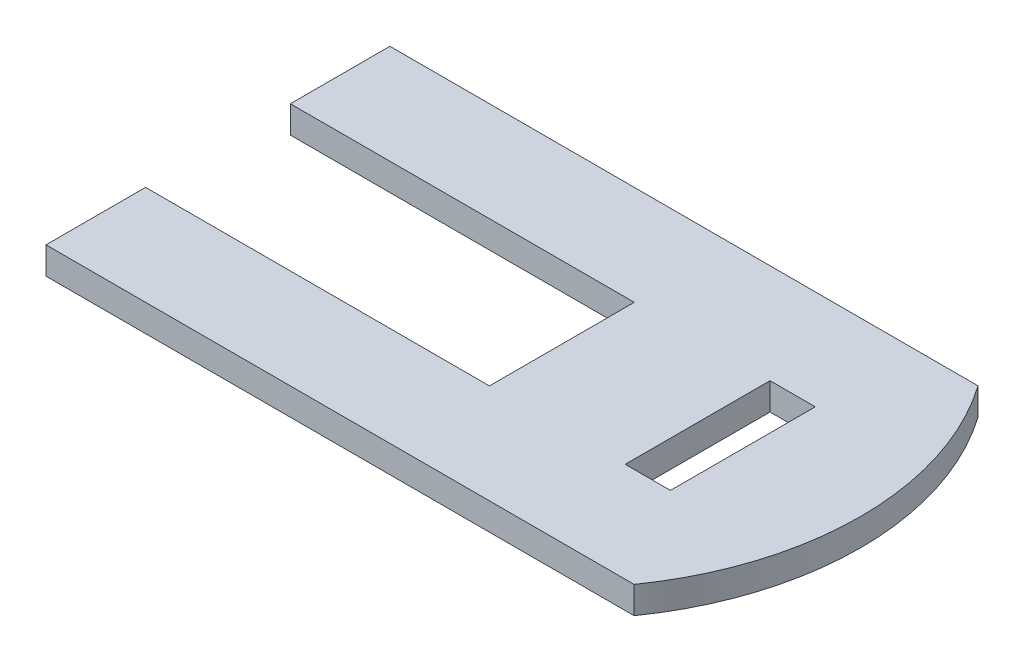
from build123d import *

# Parameters (mm, degrees)
SKETCH1_W      = 5
SKETCH1_H      = 16
EXTRUDE1_DEPTH = 3


with BuildPart() as part:
    # Sketch1 → Extrude1 (new body)
    with BuildSketch(Plane(origin=(0, 0, 0), x_dir=(1, 0, 0), z_dir=(0, 1, 0))):
        with BuildLine():
            Line((0, 27), (38, 27))
            Line((38, 27), (38, 11))
            Line((38, 11), (0, 11))
            Line((0, 11), (0, 0))
            Line((0, 0), (64.981475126, 0))
            ThreePointArc((64.981475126, 0), (71, 19), (64.981475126, 38))
            Line((64.981475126, 38), (0, 38))
            Line((0, 38), (0, 27))
        make_face()
        with Locations((55.5, 19)):
            Rectangle(SKETCH1_W, SKETCH1_H, mode=Mode.SUBTRACT)
    extrude(amount=EXTRUDE1_DEPTH)


solid = part.part
